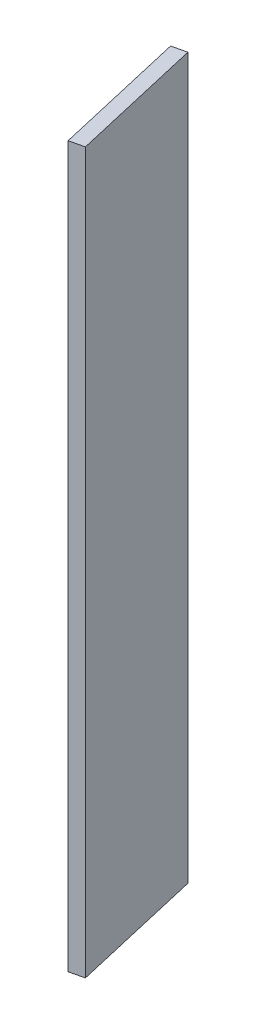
ISO-10303-21;
HEADER;
FILE_DESCRIPTION(('STEP AP214'),'2;1');
FILE_NAME('part.step','',(''),(''),'','','');
FILE_SCHEMA(('AUTOMOTIVE_DESIGN { 1 0 10303 214 1 1 1 1 }'));
ENDSEC;
DATA;
#1=APPLICATION_CONTEXT('core data for automotive mechanical design processes');
#2=APPLICATION_PROTOCOL_DEFINITION('international standard','automotive_design',2000,#1);
#3=PRODUCT_CONTEXT('',#1,'mechanical');
#4=PRODUCT('Part','Part','',(#3));
#5=PRODUCT_RELATED_PRODUCT_CATEGORY('part','',(#4));
#6=PRODUCT_DEFINITION_FORMATION('','',#4);
#7=PRODUCT_DEFINITION_CONTEXT('part definition',#1,'design');
#8=PRODUCT_DEFINITION('design','',#6,#7);
#9=PRODUCT_DEFINITION_SHAPE('','',#8);
#10=(LENGTH_UNIT() NAMED_UNIT(*) SI_UNIT(.MILLI.,.METRE.));
#11=(NAMED_UNIT(*) PLANE_ANGLE_UNIT() SI_UNIT($,.RADIAN.));
#12=(NAMED_UNIT(*) SI_UNIT($,.STERADIAN.) SOLID_ANGLE_UNIT());
#13=UNCERTAINTY_MEASURE_WITH_UNIT(LENGTH_MEASURE(1.E-05),#10,'distance_accuracy_value','');
#14=(GEOMETRIC_REPRESENTATION_CONTEXT(3) GLOBAL_UNCERTAINTY_ASSIGNED_CONTEXT((#13)) GLOBAL_UNIT_ASSIGNED_CONTEXT((#10,
#11,#12)) REPRESENTATION_CONTEXT('',''));
#15=CARTESIAN_POINT('',(0.,0.,0.));
#16=DIRECTION('',(0.,0.,1.));
#17=DIRECTION('',(1.,0.,0.));
#18=AXIS2_PLACEMENT_3D('',#15,#16,#17);
#19=CARTESIAN_POINT('',(390.,599.787695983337,0.));
#20=DIRECTION('',(0.224859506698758,0.,0.97439119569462));
#21=DIRECTION('',(0.97439119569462,0.,-0.224859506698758));
#22=AXIS2_PLACEMENT_3D('',#19,#20,#21);
#23=PLANE('',#22);
#24=DIRECTION('',(-0.97439119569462,0.,0.224859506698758));
#25=VECTOR('',#24,1.);
#26=CARTESIAN_POINT('',(390.,500.,0.));
#27=LINE('',#26,#25);
#28=CARTESIAN_POINT('',(390.,500.,0.));
#29=VERTEX_POINT('',#28);
#30=CARTESIAN_POINT('',(380.256088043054,500.,2.24859506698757));
#31=VERTEX_POINT('',#30);
#32=EDGE_CURVE('E43',#29,#31,#27,.T.);
#33=ORIENTED_EDGE('',*,*,#32,.F.);
#34=DIRECTION('',(0.,-1.,0.));
#35=VECTOR('',#34,1.);
#36=CARTESIAN_POINT('',(390.,599.787695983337,0.));
#37=LINE('',#36,#35);
#38=CARTESIAN_POINT('',(390.,0.,0.));
#39=VERTEX_POINT('',#38);
#40=EDGE_CURVE('E91',#29,#39,#37,.T.);
#41=ORIENTED_EDGE('',*,*,#40,.T.);
#42=DIRECTION('',(-0.97439119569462,0.,0.224859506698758));
#43=VECTOR('',#42,1.);
#44=CARTESIAN_POINT('',(390.,0.,0.));
#45=LINE('',#44,#43);
#46=CARTESIAN_POINT('',(380.256088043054,0.,2.24859506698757));
#47=VERTEX_POINT('',#46);
#48=EDGE_CURVE('E86',#39,#47,#45,.T.);
#49=ORIENTED_EDGE('',*,*,#48,.T.);
#50=DIRECTION('',(0.,-1.,0.));
#51=VECTOR('',#50,1.);
#52=CARTESIAN_POINT('',(380.256088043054,599.787695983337,2.24859506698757));
#53=LINE('',#52,#51);
#54=EDGE_CURVE('E72',#31,#47,#53,.T.);
#55=ORIENTED_EDGE('',*,*,#54,.F.);
#56=EDGE_LOOP('',(#33,#41,#49,#55));
#57=FACE_BOUND('',#56,.T.);
#58=ADVANCED_FACE('F36',(#57),#23,.F.);
#59=CARTESIAN_POINT('',(380.256088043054,599.787695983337,2.24859506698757));
#60=DIRECTION('',(0.97439119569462,0.,-0.224859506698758));
#61=DIRECTION('',(-0.224859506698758,0.,-0.97439119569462));
#62=AXIS2_PLACEMENT_3D('',#59,#60,#61);
#63=PLANE('',#62);
#64=DIRECTION('',(0.224859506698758,0.,0.97439119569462));
#65=VECTOR('',#64,1.);
#66=CARTESIAN_POINT('',(380.256088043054,500.,2.24859506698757));
#67=LINE('',#66,#65);
#68=CARTESIAN_POINT('',(401.617741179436,500.,94.8157586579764));
#69=VERTEX_POINT('',#68);
#70=EDGE_CURVE('E52',#31,#69,#67,.T.);
#71=ORIENTED_EDGE('',*,*,#70,.F.);
#72=ORIENTED_EDGE('',*,*,#54,.T.);
#73=DIRECTION('',(0.224859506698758,0.,0.97439119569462));
#74=VECTOR('',#73,1.);
#75=CARTESIAN_POINT('',(380.256088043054,0.,2.24859506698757));
#76=LINE('',#75,#74);
#77=CARTESIAN_POINT('',(401.617741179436,0.,94.8157586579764));
#78=VERTEX_POINT('',#77);
#79=EDGE_CURVE('E76',#47,#78,#76,.T.);
#80=ORIENTED_EDGE('',*,*,#79,.T.);
#81=DIRECTION('',(0.,-1.,0.));
#82=VECTOR('',#81,1.);
#83=CARTESIAN_POINT('',(401.617741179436,599.787695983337,94.8157586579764));
#84=LINE('',#83,#82);
#85=EDGE_CURVE('E81',#69,#78,#84,.T.);
#86=ORIENTED_EDGE('',*,*,#85,.F.);
#87=EDGE_LOOP('',(#71,#72,#80,#86));
#88=FACE_BOUND('',#87,.T.);
#89=ADVANCED_FACE('F74',(#88),#63,.F.);
#90=CARTESIAN_POINT('',(411.361653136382,599.787695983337,92.5671635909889));
#91=DIRECTION('',(-0.224859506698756,0.,-0.97439119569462));
#92=DIRECTION('',(-0.974391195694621,0.,0.224859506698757));
#93=AXIS2_PLACEMENT_3D('',#90,#91,#92);
#94=PLANE('',#93);
#95=DIRECTION('',(0.974391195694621,0.,-0.224859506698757));
#96=VECTOR('',#95,1.);
#97=CARTESIAN_POINT('',(411.361653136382,500.,92.5671635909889));
#98=LINE('',#97,#96);
#99=CARTESIAN_POINT('',(411.361653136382,500.,92.5671635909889));
#100=VERTEX_POINT('',#99);
#101=EDGE_CURVE('E80',#69,#100,#98,.T.);
#102=ORIENTED_EDGE('',*,*,#101,.F.);
#103=ORIENTED_EDGE('',*,*,#85,.T.);
#104=DIRECTION('',(0.97439119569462,0.,-0.224859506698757));
#105=VECTOR('',#104,1.);
#106=CARTESIAN_POINT('',(411.361653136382,0.,92.5671635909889));
#107=LINE('',#106,#105);
#108=CARTESIAN_POINT('',(411.361653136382,0.,92.5671635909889));
#109=VERTEX_POINT('',#108);
#110=EDGE_CURVE('E88',#78,#109,#107,.T.);
#111=ORIENTED_EDGE('',*,*,#110,.T.);
#112=DIRECTION('',(0.,-1.,0.));
#113=VECTOR('',#112,1.);
#114=CARTESIAN_POINT('',(411.361653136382,599.787695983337,92.5671635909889));
#115=LINE('',#114,#113);
#116=EDGE_CURVE('E101',#100,#109,#115,.T.);
#117=ORIENTED_EDGE('',*,*,#116,.F.);
#118=EDGE_LOOP('',(#102,#103,#111,#117));
#119=FACE_BOUND('',#118,.T.);
#120=ADVANCED_FACE('F104',(#119),#94,.F.);
#121=CARTESIAN_POINT('',(390.,599.787695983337,0.));
#122=DIRECTION('',(-0.97439119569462,0.,0.224859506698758));
#123=DIRECTION('',(0.224859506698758,0.,0.97439119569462));
#124=AXIS2_PLACEMENT_3D('',#121,#122,#123);
#125=PLANE('',#124);
#126=DIRECTION('',(-0.224859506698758,0.,-0.97439119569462));
#127=VECTOR('',#126,1.);
#128=CARTESIAN_POINT('',(390.,500.,0.));
#129=LINE('',#128,#127);
#130=EDGE_CURVE('E11',#100,#29,#129,.T.);
#131=ORIENTED_EDGE('',*,*,#130,.F.);
#132=ORIENTED_EDGE('',*,*,#116,.T.);
#133=DIRECTION('',(-0.224859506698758,0.,-0.97439119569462));
#134=VECTOR('',#133,1.);
#135=CARTESIAN_POINT('',(390.,0.,0.));
#136=LINE('',#135,#134);
#137=EDGE_CURVE('E98',#109,#39,#136,.T.);
#138=ORIENTED_EDGE('',*,*,#137,.T.);
#139=ORIENTED_EDGE('',*,*,#40,.F.);
#140=EDGE_LOOP('',(#131,#132,#138,#139));
#141=FACE_BOUND('',#140,.T.);
#142=ADVANCED_FACE('F110',(#141),#125,.F.);
#143=CARTESIAN_POINT('',(0.,0.,0.));
#144=DIRECTION('',(0.,1.,0.));
#145=DIRECTION('',(0.,0.,1.));
#146=AXIS2_PLACEMENT_3D('',#143,#144,#145);
#147=PLANE('',#146);
#148=ORIENTED_EDGE('',*,*,#48,.F.);
#149=ORIENTED_EDGE('',*,*,#137,.F.);
#150=ORIENTED_EDGE('',*,*,#110,.F.);
#151=ORIENTED_EDGE('',*,*,#79,.F.);
#152=EDGE_LOOP('',(#148,#149,#150,#151));
#153=FACE_BOUND('',#152,.T.);
#154=ADVANCED_FACE('F84',(#153),#147,.F.);
#155=CARTESIAN_POINT('',(164.822751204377,500.,638.878970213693));
#156=DIRECTION('',(0.,1.,0.));
#157=DIRECTION('',(-1.,0.,0.));
#158=AXIS2_PLACEMENT_3D('',#155,#156,#157);
#159=PLANE('',#158);
#160=ORIENTED_EDGE('',*,*,#32,.T.);
#161=ORIENTED_EDGE('',*,*,#70,.T.);
#162=ORIENTED_EDGE('',*,*,#101,.T.);
#163=ORIENTED_EDGE('',*,*,#130,.T.);
#164=EDGE_LOOP('',(#160,#161,#162,#163));
#165=FACE_BOUND('',#164,.T.);
#166=ADVANCED_FACE('F108',(#165),#159,.T.);
#167=CLOSED_SHELL('',(#58,#89,#120,#142,#154,#166));
#168=MANIFOLD_SOLID_BREP('B2',#167);
#169=ADVANCED_BREP_SHAPE_REPRESENTATION('',(#18,#168),#14);
#170=SHAPE_DEFINITION_REPRESENTATION(#9,#169);
ENDSEC;
END-ISO-10303-21;
